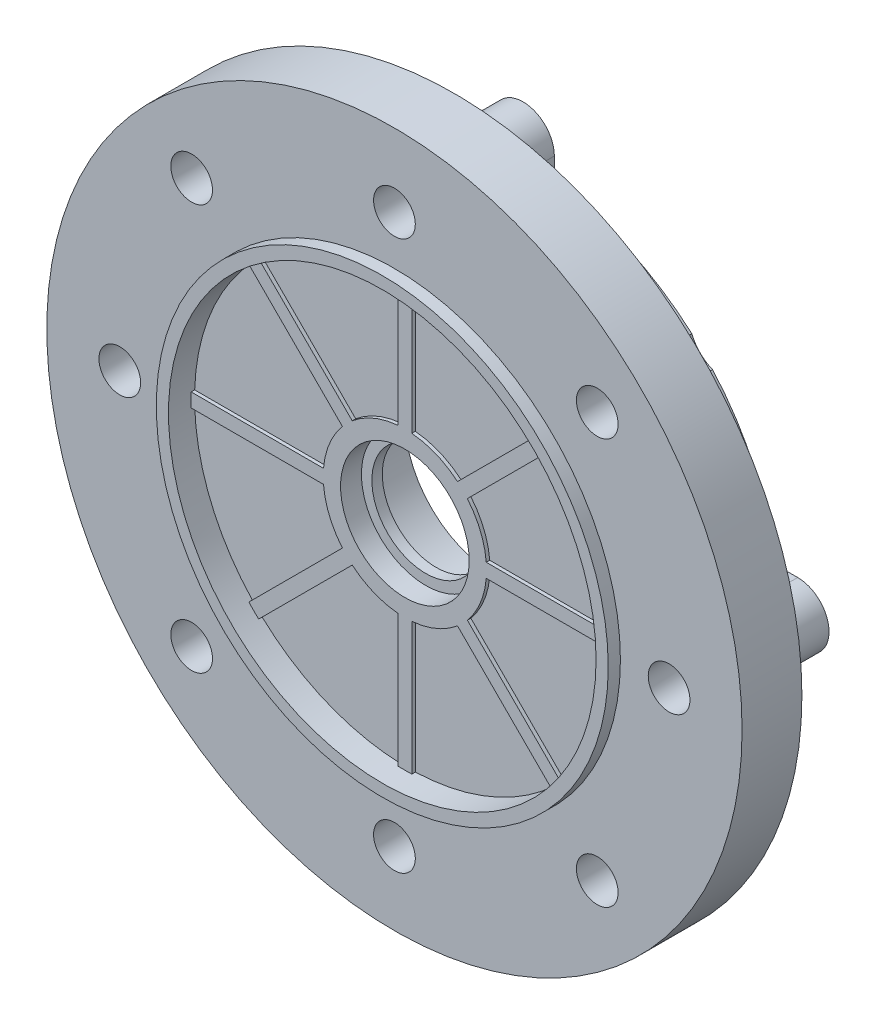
from build123d import *

# Parameters (mm, degrees)
SKETCH_2_R               = 70
CUT_EXTRUDE_1_DEPTH      = 4
CUT_EXTRUDE_5_DEPTH      = 33
PATTERN_CIRCULAR_1_COUNT = 8
EXTRUDE_START            = 25
EXTRUDE_1_DEPTH          = 25
PATTERN_CIRCULAR_2_COUNT = 4
SKETCH_11_R              = 6
CUT_EXTRUDE_6_DEPTH      = 143.929471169
SKETCH_12_R              = 10.5
CUT_EXTRUDE_7_DEPTH      = 33
PATTERN_CIRCULAR_3_COUNT = 4
SKETCH_15_R              = 3
CUT_EXTRUDE_8_DEPTH      = 148.106254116
PATTERN_CIRCULAR_4_COUNT = 4
SKETCH_16_R              = 6
CUT_EXTRUDE_9_DEPTH      = 29
PATTERN_CIRCULAR_5_COUNT = 4
SKETCH_17_W              = 4
SKETCH_17_H              = 41.331762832
SKETCH_17_W_2            = 41.331762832
SKETCH_17_H_2            = 4
EXTRUDE_3_DEPTH          = 1
SKETCH_18_W              = 4
SKETCH_18_H              = 38.672068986
EXTRUDE_4_DEPTH          = 3
PATTERN_CIRCULAR_6_COUNT = 8
SKETCH_19_R              = 5
EXTRUDE_5_DEPTH          = 20.5
PATTERN_CIRCULAR_7_COUNT = 6
PATTERN_CIRCULAR_8_COUNT = 3


with BuildPart() as part:
    # Sketch 1 → Revolve 1 (revolve)
    with BuildSketch(Plane(origin=(0, 0, 0), x_dir=(1, 0, 0), z_dir=(0, 1, 0))):
        with BuildLine():
            Line((15.5, 5.829041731), (22.5, 5.829041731))
            Line((22.5, 5.829041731), (22.5, 6.829041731))
            Line((22.5, 6.829041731), (26, 6.829041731))
            Line((26, 6.829041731), (26, 22.829041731))
            Line((26, 22.829041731), (34, 22.829041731))
            Line((34, 22.829041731), (34, 7.329041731))
            ThreePointArc((34, 7.329041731), (35.464466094, 3.793507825), (39, 2.329041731))
            Line((39, 2.329041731), (64, 2.329041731))
            ThreePointArc((64, 2.329041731), (67.535533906, 3.793507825), (69, 7.329041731))
            Line((69, 7.329041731), (69, 30.829041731))
            Line((69, 30.829041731), (73, 30.829041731))
            Line((73, 30.829041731), (73, 11.037342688))
            Line((73, 11.037342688), (100, 11.037342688))
            Line((100, 11.037342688), (100, -6.170958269))
            Line((100, -6.170958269), (65, -6.170958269))
            Line((65, -6.170958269), (65, -9.670958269))
            Line((65, -9.670958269), (61.5, -9.670958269))
            Line((61.5, -9.670958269), (61.5, -2.170958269))
            Line((61.5, -2.170958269), (23.5, -2.170958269))
            Line((23.5, -2.170958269), (23.5, -3.170958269))
            Line((23.5, -3.170958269), (18.5, -3.170958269))
            Line((18.5, -3.170958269), (18.5, 2.829041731))
            Line((18.5, 2.829041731), (15.5, 2.829041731))
            Line((15.5, 2.829041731), (15.5, 5.829041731))
        make_face()
    revolve(axis=Axis((0, 0, 0), (0, 0, -1)))

    # Sketch 2 → Cut-Extrude 1 (cut)
    with BuildSketch(Plane(origin=(0, 0, -30.829041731), x_dir=(-1, 0, 0), z_dir=(0, 0, -1))):
        Circle(SKETCH_2_R)
    extrude(amount=-CUT_EXTRUDE_1_DEPTH, mode=Mode.SUBTRACT)

    # Sketch 3 → Cut-Extrude 5 (cut)
    with BuildSketch(Plane(origin=(0, 0, -30.829041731), x_dir=(-1, 0, 0), z_dir=(0, 0, -1))):
        with BuildLine():
            Line((9, 75.552961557), (9, 91.214034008))
            ThreePointArc((9, 91.214034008), (10.02185858, 93.469462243), (12.391304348, 94.188404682))
            ThreePointArc((12.391304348, 94.188404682), (36.354926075, 87.768555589), (57.839284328, 75.363234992))
            ThreePointArc((57.839284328, 75.363234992), (59.006366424, 73.179414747), (58.134100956, 70.862023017))
            Line((58.134100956, 70.862023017), (47.060050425, 59.787972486))
            ThreePointArc((47.060050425, 59.787972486), (45.174755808, 58.918591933), (43.176426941, 59.481477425))
            ThreePointArc((43.176426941, 59.481477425), (28.127232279, 67.90514564), (11.529411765, 72.590100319))
            ThreePointArc((11.529411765, 72.590100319), (9.718359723, 73.605112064), (9, 75.552961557))
        make_face()
    cut_extrude_5 = extrude(amount=-CUT_EXTRUDE_5_DEPTH, mode=Mode.SUBTRACT)

    # Pattern Circular 1: Cut-Extrude 5 ×8 about axis
    pattern_circular_1_axis = Axis((0, 0, 0), (0, 0, 1))
    for i in range(1, PATTERN_CIRCULAR_1_COUNT):
        add(cut_extrude_5.rotate(pattern_circular_1_axis, i * 360 / PATTERN_CIRCULAR_1_COUNT), mode=Mode.SUBTRACT)

    # Sketch 4 → Extrude 1 (add)
    with BuildSketch(Plane(origin=(0, 0, -5.829041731), x_dir=(-1, 0, 0), z_dir=(0, 0, -1)).offset(EXTRUDE_START)):
        with BuildLine():
            Line((-9, 79), (-9, 75.552961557))
            ThreePointArc((-9, 75.552961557), (-9.718359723, 73.605112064), (-11.529411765, 72.590100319))
            ThreePointArc((-11.529411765, 72.590100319), (0, 73.5), (11.529411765, 72.590100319))
            ThreePointArc((11.529411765, 72.590100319), (9.718359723, 73.605112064), (9, 75.552961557))
            Line((9, 75.552961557), (9, 79))
            ThreePointArc((9, 79), (0, 88), (-9, 79))
        make_face()
    extrude_1 = extrude(amount=-EXTRUDE_1_DEPTH)

    # Pattern Circular 2: Extrude 1 ×4 about axis
    pattern_circular_2_axis = Axis((0, 0, 0), (0, 0, 1))
    for i in range(1, PATTERN_CIRCULAR_2_COUNT):
        add(extrude_1.rotate(pattern_circular_2_axis, i * 360 / PATTERN_CIRCULAR_2_COUNT))

    # Sketch 11 → Cut-Extrude 6 (cut, through all)
    with BuildSketch(Plane(origin=(0, 0, -11.037342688), x_dir=(-1, 0, 0), z_dir=(0, 0, -1))):
        with Locations((-58.336309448, 58.336309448)):
            Circle(SKETCH_11_R)
        with Locations((58.336309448, 58.336309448)):
            Circle(SKETCH_11_R)
        with Locations((58.336309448, -58.336309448)):
            Circle(SKETCH_11_R)
        with Locations((-58.336309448, -58.336309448)):
            Circle(SKETCH_11_R)
    extrude(amount=-CUT_EXTRUDE_6_DEPTH, mode=Mode.SUBTRACT)

    # Sketch 12 → Cut-Extrude 7 (cut)
    with BuildSketch(Plane(origin=(0, 0, -11.037342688), x_dir=(-1, 0, 0), z_dir=(0, 0, -1))):
        with Locations((-58.336309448, 58.336309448)):
            Circle(SKETCH_12_R)
    cut_extrude_7 = extrude(amount=CUT_EXTRUDE_7_DEPTH, mode=Mode.SUBTRACT)

    # Pattern Circular 3: Cut-Extrude 7 ×4 about axis
    pattern_circular_3_axis = Axis((0, 0, 0), (0, 0, 1))
    for i in range(1, PATTERN_CIRCULAR_3_COUNT):
        add(cut_extrude_7.rotate(pattern_circular_3_axis, i * 360 / PATTERN_CIRCULAR_3_COUNT), mode=Mode.SUBTRACT)

    # Sketch 15 → Cut-Extrude 8 (cut, through all)
    with BuildSketch(Plane(origin=(0, 0, -30.829041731), x_dir=(-1, 0, 0), z_dir=(0, 0, -1))):
        with Locations((0, 79)):
            Circle(SKETCH_15_R)
    cut_extrude_8 = extrude(amount=-CUT_EXTRUDE_8_DEPTH, mode=Mode.SUBTRACT)

    # Pattern Circular 4: Cut-Extrude 8 ×4 about axis
    pattern_circular_4_axis = Axis((0, 0, 0), (0, 0, 1))
    for i in range(1, PATTERN_CIRCULAR_4_COUNT):
        add(cut_extrude_8.rotate(pattern_circular_4_axis, i * 360 / PATTERN_CIRCULAR_4_COUNT), mode=Mode.SUBTRACT)

    # Sketch 16 → Cut-Extrude 9 (cut)
    with BuildSketch(Plane.XY.offset(6.170958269)):
        with Locations((0, 79)):
            Circle(SKETCH_16_R)
    cut_extrude_9 = extrude(amount=-CUT_EXTRUDE_9_DEPTH, mode=Mode.SUBTRACT)

    # Pattern Circular 5: Cut-Extrude 9 ×4 about axis
    pattern_circular_5_axis = Axis((0, 0, 0), (0, 0, 1))
    for i in range(1, PATTERN_CIRCULAR_5_COUNT):
        add(cut_extrude_9.rotate(pattern_circular_5_axis, i * 360 / PATTERN_CIRCULAR_5_COUNT), mode=Mode.SUBTRACT)

    # Sketch 17 → Extrude 3 (add)
    with BuildSketch(Plane.XY.offset(2.170958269)):
        Polygon((14.642488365, 17.47091549), (17.47091549, 14.642488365), (46.696885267, 43.868458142), (43.868458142, 46.696885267), align=None)
        with Locations((0, 43.373487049)):
            Rectangle(SKETCH_17_W, SKETCH_17_H)
        with Locations((43.373487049, 0)):
            Rectangle(SKETCH_17_W_2, SKETCH_17_H_2)
        Polygon((17.47091549, -14.642488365), (14.642488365, -17.47091549), (43.868458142, -46.696885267), (46.696885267, -43.868458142), align=None)
        with Locations((0, -43.373487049)):
            Rectangle(SKETCH_17_W, SKETCH_17_H)
        Polygon((-14.642488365, -17.47091549), (-17.47091549, -14.642488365), (-46.696885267, -43.868458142), (-43.868458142, -46.696885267), align=None)
        with Locations((-43.373487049, 0)):
            Rectangle(SKETCH_17_W_2, SKETCH_17_H_2)
        Polygon((-17.47091549, 14.642488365), (-14.642488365, 17.47091549), (-43.868458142, 46.696885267), (-46.696885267, 43.868458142), align=None)
    extrude(amount=EXTRUDE_3_DEPTH)

    # Sketch 18 → Extrude 4 (add)
    with BuildSketch(Plane(origin=(0, 0, -2.329041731), x_dir=(-1, 0, 0), z_dir=(0, 0, -1))):
        with Locations((0, 51.358154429)):
            Rectangle(SKETCH_18_W, SKETCH_18_H)
    extrude_4 = extrude(amount=EXTRUDE_4_DEPTH)

    # Pattern Circular 6: Extrude 4 ×8 about axis
    pattern_circular_6_axis = Axis((0, 0, 0), (0, 0, 1))
    for i in range(1, PATTERN_CIRCULAR_6_COUNT):
        add(extrude_4.rotate(pattern_circular_6_axis, i * 360 / PATTERN_CIRCULAR_6_COUNT))

    # Sketch 19 → Extrude 5 (add)
    with BuildSketch(Plane(origin=(0, 0, -22.829041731), x_dir=(-1, 0, 0), z_dir=(0, 0, -1))):
        with Locations((-29.455003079, 13.735093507)):
            Circle(SKETCH_19_R)
    extrude_5 = extrude(amount=-EXTRUDE_5_DEPTH)

    # Pattern Circular 7: Extrude 5 ×6 about axis
    pattern_circular_7_axis = Axis((0, 0, 0), (0, 0, 1))
    for i in range(1, PATTERN_CIRCULAR_7_COUNT):
        add(extrude_5.rotate(pattern_circular_7_axis, i * 360 / PATTERN_CIRCULAR_7_COUNT))

    # Cut-Extrude 10 cone 1 section (on through the dimple's axis) → Cut-Extrude 10 (revolve, cut)
    with BuildSketch(Plane(origin=(29.455003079, 13.735093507, -22.829041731), x_dir=(0, 1, 0), z_dir=(1, 0, 0))):
        Polygon((0, 0), (2.05, 0), (0, 2.05), align=None)
    cut_extrude_10 = revolve(axis=Axis((29.455003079, 13.735093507, -22.829041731), (0, 0, 1)), mode=Mode.SUBTRACT)

    # Pattern Circular 8: Cut-Extrude 10 ×3 about axis
    pattern_circular_8_axis = Axis((0, 0, 0), (0, 0, 1))
    for i in range(1, PATTERN_CIRCULAR_8_COUNT):
        add(cut_extrude_10.rotate(pattern_circular_8_axis, i * 360 / PATTERN_CIRCULAR_8_COUNT), mode=Mode.SUBTRACT)


solid = part.part
